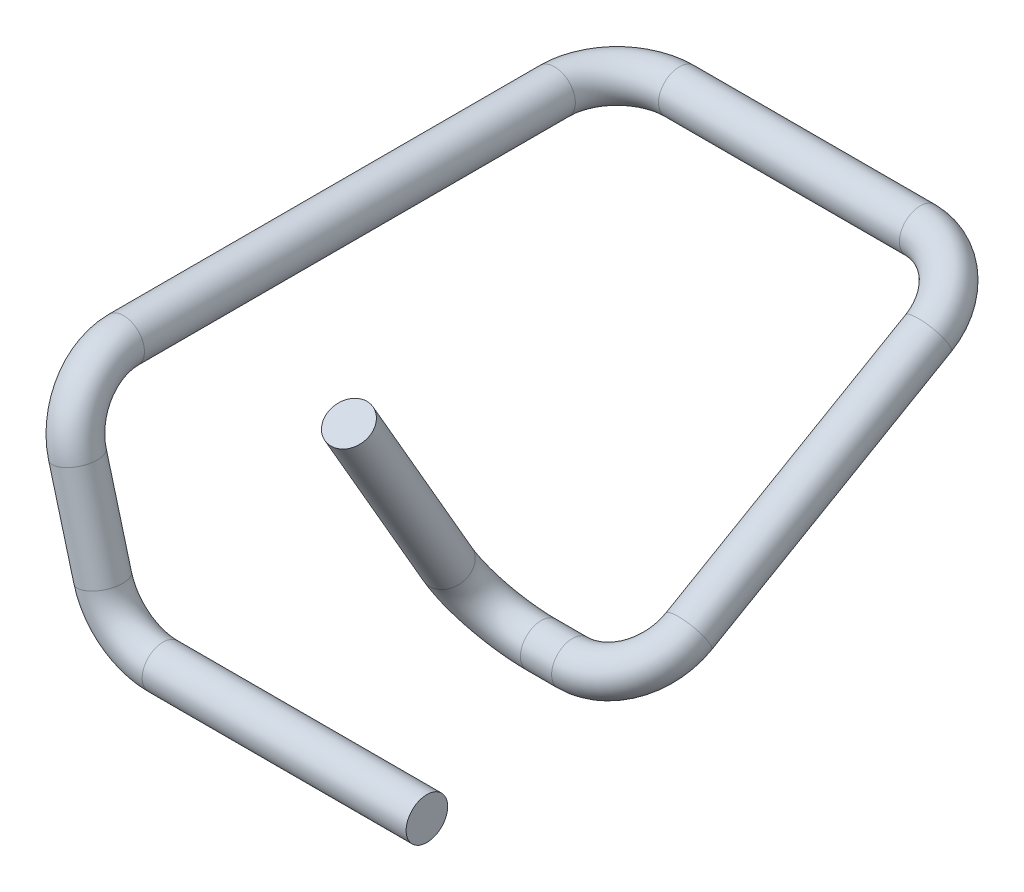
from build123d import *

# Parameters (mm, degrees)
SWEEP1_PROFILE_R = 10


with BuildPart() as part:
    # Sweep1: sweep along a curve in space
    with BuildLine() as sweep1_path:
        Line((0, 0, 0), (-126.980190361, 0, 0))
        ThreePointArc((-126.980190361, 0, 0), (-145.243033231, 6.199399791, 0), (-155.957965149, 22.235428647, 0))
        Line((-155.957965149, 22.235428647, 0), (-168.117333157, 67.61480784, 0))
        ThreePointArc((-168.117333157, 67.61480784, 0), (-173.607714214, 88.105188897, -8.786796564), (-175.88190451, 96.592582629, -30))
        Line((-175.88190451, 96.592582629, -30), (-175.88190451, 96.592582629, -237.303260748))
        ThreePointArc((-175.88190451, 96.592582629, -237.303260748), (-167.095107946, 96.592582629, -258.516464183), (-145.88190451, 96.592582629, -267.303260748))
        Line((-145.88190451, 96.592582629, -267.303260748), (-30, 96.592582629, -267.303260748))
        ThreePointArc((-30, 96.592582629, -267.303260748), (-8.786796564, 92.199184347, -259.693671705), (0, 81.592582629, -241.322498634))
        Line((0, 81.592582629, -241.322498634), (0, 15, -125.980762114))
        ThreePointArc((0, 15, -125.980762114), (-8.786796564, 4.393398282, -107.609589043), (-30, 0, -100))
        Line((-30, 0, -100), (-45, 0, -100))
        ThreePointArc((-45, 0, -100), (-66.213203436, 7.609589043, -95.606601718), (-75, 25.980762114, -85))
        Line((-75, 25.980762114, -85), (-75, 108.253175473, -37.5))
    # Sweep1 profile (on start of the path) → Sweep1 (sweep)
    with BuildSketch(Plane(origin=(0, 0, 0), x_dir=(0, 0, -1), z_dir=(-1, 0, 0))):
        Circle(SWEEP1_PROFILE_R)
    sweep(path=sweep1_path.line)


solid = part.part
